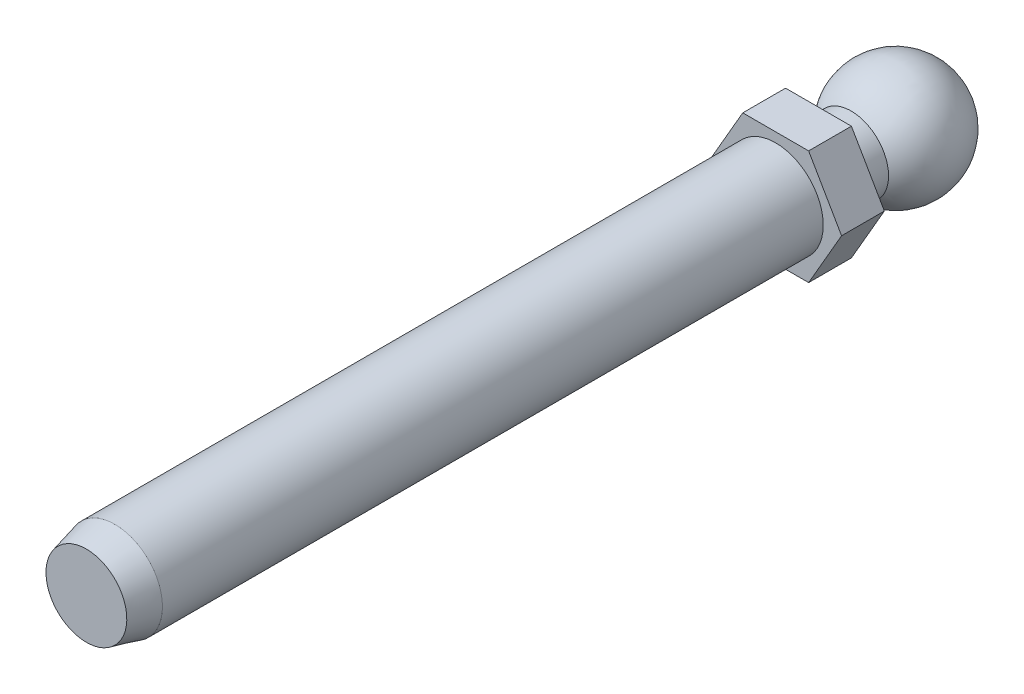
ISO-10303-21;
HEADER;
FILE_DESCRIPTION(('STEP AP214'),'2;1');
FILE_NAME('part.step','',(''),(''),'','','');
FILE_SCHEMA(('AUTOMOTIVE_DESIGN { 1 0 10303 214 1 1 1 1 }'));
ENDSEC;
DATA;
#1=APPLICATION_CONTEXT('core data for automotive mechanical design processes');
#2=APPLICATION_PROTOCOL_DEFINITION('international standard','automotive_design',2000,#1);
#3=PRODUCT_CONTEXT('',#1,'mechanical');
#4=PRODUCT('Part','Part','',(#3));
#5=PRODUCT_RELATED_PRODUCT_CATEGORY('part','',(#4));
#6=PRODUCT_DEFINITION_FORMATION('','',#4);
#7=PRODUCT_DEFINITION_CONTEXT('part definition',#1,'design');
#8=PRODUCT_DEFINITION('design','',#6,#7);
#9=PRODUCT_DEFINITION_SHAPE('','',#8);
#10=(LENGTH_UNIT() NAMED_UNIT(*) SI_UNIT(.MILLI.,.METRE.));
#11=(NAMED_UNIT(*) PLANE_ANGLE_UNIT() SI_UNIT($,.RADIAN.));
#12=(NAMED_UNIT(*) SI_UNIT($,.STERADIAN.) SOLID_ANGLE_UNIT());
#13=UNCERTAINTY_MEASURE_WITH_UNIT(LENGTH_MEASURE(1.E-05),#10,'distance_accuracy_value','');
#14=(GEOMETRIC_REPRESENTATION_CONTEXT(3) GLOBAL_UNCERTAINTY_ASSIGNED_CONTEXT((#13)) GLOBAL_UNIT_ASSIGNED_CONTEXT((#10,
#11,#12)) REPRESENTATION_CONTEXT('',''));
#15=CARTESIAN_POINT('',(0.,0.,0.));
#16=DIRECTION('',(0.,0.,1.));
#17=DIRECTION('',(1.,0.,0.));
#18=AXIS2_PLACEMENT_3D('',#15,#16,#17);
#19=CARTESIAN_POINT('',(0.,0.,0.));
#20=DIRECTION('',(1.,0.,0.));
#21=DIRECTION('',(0.,1.,0.));
#22=AXIS2_PLACEMENT_3D('',#19,#20,#21);
#23=SPHERICAL_SURFACE('',#22,12.25);
#24=CARTESIAN_POINT('',(-12.25,0.,0.));
#25=VERTEX_POINT('',#24);
#26=VERTEX_LOOP('',#25);
#27=FACE_BOUND('',#26,.T.);
#28=CARTESIAN_POINT('',(12.25,0.,0.));
#29=VERTEX_POINT('',#28);
#30=VERTEX_LOOP('',#29);
#31=FACE_BOUND('',#30,.T.);
#32=CARTESIAN_POINT('',(0.,0.,9.38332963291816));
#33=DIRECTION('',(0.,0.,1.));
#34=DIRECTION('',(1.,0.,0.));
#35=AXIS2_PLACEMENT_3D('',#32,#33,#34);
#36=CIRCLE('',#35,7.875);
#37=CARTESIAN_POINT('',(7.875,0.,9.38332963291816));
#38=VERTEX_POINT('',#37);
#39=EDGE_CURVE('E20',#38,#38,#36,.T.);
#40=ORIENTED_EDGE('',*,*,#39,.F.);
#41=EDGE_LOOP('',(#40));
#42=FACE_BOUND('',#41,.T.);
#43=ADVANCED_FACE('F16',(#27,#31,#42),#23,.T.);
#44=CARTESIAN_POINT('',(0.,0.,0.));
#45=DIRECTION('',(0.,0.,1.));
#46=DIRECTION('',(1.,0.,0.));
#47=AXIS2_PLACEMENT_3D('',#44,#45,#46);
#48=CYLINDRICAL_SURFACE('',#47,7.875);
#49=ORIENTED_EDGE('',*,*,#39,.T.);
#50=EDGE_LOOP('',(#49));
#51=FACE_BOUND('',#50,.T.);
#52=CARTESIAN_POINT('',(0.,0.,16.25));
#53=DIRECTION('',(0.,0.,1.));
#54=DIRECTION('',(1.,0.,0.));
#55=AXIS2_PLACEMENT_3D('',#52,#53,#54);
#56=CIRCLE('',#55,7.875);
#57=CARTESIAN_POINT('',(7.875,0.,16.25));
#58=VERTEX_POINT('',#57);
#59=EDGE_CURVE('E79',#58,#58,#56,.F.);
#60=ORIENTED_EDGE('',*,*,#59,.T.);
#61=EDGE_LOOP('',(#60));
#62=FACE_BOUND('',#61,.T.);
#63=ADVANCED_FACE('F74',(#51,#62),#48,.T.);
#64=CARTESIAN_POINT('',(0.,0.,16.25));
#65=DIRECTION('',(0.,0.,1.));
#66=DIRECTION('',(1.,0.,0.));
#67=AXIS2_PLACEMENT_3D('',#64,#65,#66);
#68=PLANE('',#67);
#69=ORIENTED_EDGE('',*,*,#59,.F.);
#70=EDGE_LOOP('',(#69));
#71=FACE_BOUND('',#70,.T.);
#72=DIRECTION('',(-0.5,0.866025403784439,0.));
#73=VECTOR('',#72,1.);
#74=CARTESIAN_POINT('',(6.92820323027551,12.,16.25));
#75=LINE('',#74,#73);
#76=CARTESIAN_POINT('',(13.856406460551,0.,16.25));
#77=VERTEX_POINT('',#76);
#78=CARTESIAN_POINT('',(6.92820323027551,12.,16.25));
#79=VERTEX_POINT('',#78);
#80=EDGE_CURVE('E81',#77,#79,#75,.T.);
#81=ORIENTED_EDGE('',*,*,#80,.F.);
#82=DIRECTION('',(0.5,0.866025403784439,0.));
#83=VECTOR('',#82,1.);
#84=CARTESIAN_POINT('',(13.856406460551,0.,16.25));
#85=LINE('',#84,#83);
#86=CARTESIAN_POINT('',(6.92820323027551,-12.,16.25));
#87=VERTEX_POINT('',#86);
#88=EDGE_CURVE('E114',#87,#77,#85,.T.);
#89=ORIENTED_EDGE('',*,*,#88,.F.);
#90=DIRECTION('',(1.,0.,0.));
#91=VECTOR('',#90,1.);
#92=CARTESIAN_POINT('',(6.92820323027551,-12.,16.25));
#93=LINE('',#92,#91);
#94=CARTESIAN_POINT('',(-6.92820323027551,-12.,16.25));
#95=VERTEX_POINT('',#94);
#96=EDGE_CURVE('E111',#95,#87,#93,.T.);
#97=ORIENTED_EDGE('',*,*,#96,.F.);
#98=DIRECTION('',(0.5,-0.866025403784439,0.));
#99=VECTOR('',#98,1.);
#100=CARTESIAN_POINT('',(-6.92820323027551,-12.,16.25));
#101=LINE('',#100,#99);
#102=CARTESIAN_POINT('',(-13.856406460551,0.,16.25));
#103=VERTEX_POINT('',#102);
#104=EDGE_CURVE('E106',#103,#95,#101,.T.);
#105=ORIENTED_EDGE('',*,*,#104,.F.);
#106=DIRECTION('',(-0.5,-0.866025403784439,0.));
#107=VECTOR('',#106,1.);
#108=CARTESIAN_POINT('',(-13.856406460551,0.,16.25));
#109=LINE('',#108,#107);
#110=CARTESIAN_POINT('',(-6.92820323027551,12.,16.25));
#111=VERTEX_POINT('',#110);
#112=EDGE_CURVE('E101',#111,#103,#109,.T.);
#113=ORIENTED_EDGE('',*,*,#112,.F.);
#114=DIRECTION('',(1.,0.,0.));
#115=VECTOR('',#114,1.);
#116=CARTESIAN_POINT('',(-6.92820323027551,12.,16.25));
#117=LINE('',#116,#115);
#118=EDGE_CURVE('E96',#79,#111,#117,.F.);
#119=ORIENTED_EDGE('',*,*,#118,.F.);
#120=EDGE_LOOP('',(#81,#89,#97,#105,#113,#119));
#121=FACE_BOUND('',#120,.T.);
#122=ADVANCED_FACE('F235',(#71,#121),#68,.F.);
#123=CARTESIAN_POINT('',(6.92820323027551,12.,16.25));
#124=DIRECTION('',(0.866025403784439,0.5,0.));
#125=DIRECTION('',(-0.5,0.866025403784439,0.));
#126=AXIS2_PLACEMENT_3D('',#123,#124,#125);
#127=PLANE('',#126);
#128=ORIENTED_EDGE('',*,*,#80,.T.);
#129=DIRECTION('',(0.,0.,1.));
#130=VECTOR('',#129,1.);
#131=CARTESIAN_POINT('',(6.92820323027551,12.,16.25));
#132=LINE('',#131,#130);
#133=CARTESIAN_POINT('',(6.92820323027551,12.,25.25));
#134=VERTEX_POINT('',#133);
#135=EDGE_CURVE('E84',#134,#79,#132,.F.);
#136=ORIENTED_EDGE('',*,*,#135,.F.);
#137=DIRECTION('',(-0.5,0.866025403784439,0.));
#138=VECTOR('',#137,1.);
#139=CARTESIAN_POINT('',(13.856406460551,0.,25.25));
#140=LINE('',#139,#138);
#141=CARTESIAN_POINT('',(13.856406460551,0.,25.25));
#142=VERTEX_POINT('',#141);
#143=EDGE_CURVE('E120',#142,#134,#140,.T.);
#144=ORIENTED_EDGE('',*,*,#143,.F.);
#145=DIRECTION('',(0.,0.,1.));
#146=VECTOR('',#145,1.);
#147=CARTESIAN_POINT('',(13.856406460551,0.,16.25));
#148=LINE('',#147,#146);
#149=EDGE_CURVE('E117',#77,#142,#148,.T.);
#150=ORIENTED_EDGE('',*,*,#149,.F.);
#151=EDGE_LOOP('',(#128,#136,#144,#150));
#152=FACE_BOUND('',#151,.T.);
#153=ADVANCED_FACE('F145',(#152),#127,.T.);
#154=CARTESIAN_POINT('',(-6.92820323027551,12.,16.25));
#155=DIRECTION('',(0.,1.,0.));
#156=DIRECTION('',(0.,0.,1.));
#157=AXIS2_PLACEMENT_3D('',#154,#155,#156);
#158=PLANE('',#157);
#159=ORIENTED_EDGE('',*,*,#118,.T.);
#160=DIRECTION('',(0.,0.,1.));
#161=VECTOR('',#160,1.);
#162=CARTESIAN_POINT('',(-6.92820323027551,12.,16.25));
#163=LINE('',#162,#161);
#164=CARTESIAN_POINT('',(-6.92820323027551,12.,25.25));
#165=VERTEX_POINT('',#164);
#166=EDGE_CURVE('E98',#165,#111,#163,.F.);
#167=ORIENTED_EDGE('',*,*,#166,.F.);
#168=DIRECTION('',(1.,0.,0.));
#169=VECTOR('',#168,1.);
#170=CARTESIAN_POINT('',(0.,12.,25.25));
#171=LINE('',#170,#169);
#172=EDGE_CURVE('E123',#134,#165,#171,.F.);
#173=ORIENTED_EDGE('',*,*,#172,.F.);
#174=ORIENTED_EDGE('',*,*,#135,.T.);
#175=EDGE_LOOP('',(#159,#167,#173,#174));
#176=FACE_BOUND('',#175,.T.);
#177=ADVANCED_FACE('F149',(#176),#158,.T.);
#178=CARTESIAN_POINT('',(-13.856406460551,0.,16.25));
#179=DIRECTION('',(-0.866025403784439,0.5,0.));
#180=DIRECTION('',(-0.5,-0.866025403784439,0.));
#181=AXIS2_PLACEMENT_3D('',#178,#179,#180);
#182=PLANE('',#181);
#183=ORIENTED_EDGE('',*,*,#112,.T.);
#184=DIRECTION('',(0.,0.,1.));
#185=VECTOR('',#184,1.);
#186=CARTESIAN_POINT('',(-13.856406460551,0.,16.25));
#187=LINE('',#186,#185);
#188=CARTESIAN_POINT('',(-13.856406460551,0.,25.25));
#189=VERTEX_POINT('',#188);
#190=EDGE_CURVE('E103',#189,#103,#187,.F.);
#191=ORIENTED_EDGE('',*,*,#190,.F.);
#192=DIRECTION('',(-0.5,-0.866025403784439,0.));
#193=VECTOR('',#192,1.);
#194=CARTESIAN_POINT('',(-6.92820323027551,12.,25.25));
#195=LINE('',#194,#193);
#196=EDGE_CURVE('E126',#165,#189,#195,.T.);
#197=ORIENTED_EDGE('',*,*,#196,.F.);
#198=ORIENTED_EDGE('',*,*,#166,.T.);
#199=EDGE_LOOP('',(#183,#191,#197,#198));
#200=FACE_BOUND('',#199,.T.);
#201=ADVANCED_FACE('F153',(#200),#182,.T.);
#202=CARTESIAN_POINT('',(-6.92820323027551,-12.,16.25));
#203=DIRECTION('',(-0.866025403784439,-0.5,0.));
#204=DIRECTION('',(0.5,-0.866025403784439,0.));
#205=AXIS2_PLACEMENT_3D('',#202,#203,#204);
#206=PLANE('',#205);
#207=ORIENTED_EDGE('',*,*,#104,.T.);
#208=DIRECTION('',(0.,0.,-1.));
#209=VECTOR('',#208,1.);
#210=CARTESIAN_POINT('',(-6.92820323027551,-12.,16.25));
#211=LINE('',#210,#209);
#212=CARTESIAN_POINT('',(-6.92820323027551,-12.,25.25));
#213=VERTEX_POINT('',#212);
#214=EDGE_CURVE('E108',#213,#95,#211,.T.);
#215=ORIENTED_EDGE('',*,*,#214,.F.);
#216=DIRECTION('',(0.5,-0.866025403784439,0.));
#217=VECTOR('',#216,1.);
#218=CARTESIAN_POINT('',(-13.856406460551,0.,25.25));
#219=LINE('',#218,#217);
#220=EDGE_CURVE('E129',#189,#213,#219,.T.);
#221=ORIENTED_EDGE('',*,*,#220,.F.);
#222=ORIENTED_EDGE('',*,*,#190,.T.);
#223=EDGE_LOOP('',(#207,#215,#221,#222));
#224=FACE_BOUND('',#223,.T.);
#225=ADVANCED_FACE('F157',(#224),#206,.T.);
#226=CARTESIAN_POINT('',(6.92820323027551,-12.,16.25));
#227=DIRECTION('',(0.,-1.,0.));
#228=DIRECTION('',(0.,0.,-1.));
#229=AXIS2_PLACEMENT_3D('',#226,#227,#228);
#230=PLANE('',#229);
#231=ORIENTED_EDGE('',*,*,#96,.T.);
#232=DIRECTION('',(0.,0.,1.));
#233=VECTOR('',#232,1.);
#234=CARTESIAN_POINT('',(6.92820323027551,-12.,16.25));
#235=LINE('',#234,#233);
#236=CARTESIAN_POINT('',(6.92820323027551,-12.,25.25));
#237=VERTEX_POINT('',#236);
#238=EDGE_CURVE('E35',#237,#87,#235,.F.);
#239=ORIENTED_EDGE('',*,*,#238,.F.);
#240=DIRECTION('',(1.,0.,0.));
#241=VECTOR('',#240,1.);
#242=CARTESIAN_POINT('',(0.,-12.,25.25));
#243=LINE('',#242,#241);
#244=EDGE_CURVE('E132',#213,#237,#243,.T.);
#245=ORIENTED_EDGE('',*,*,#244,.F.);
#246=ORIENTED_EDGE('',*,*,#214,.T.);
#247=EDGE_LOOP('',(#231,#239,#245,#246));
#248=FACE_BOUND('',#247,.T.);
#249=ADVANCED_FACE('F159',(#248),#230,.T.);
#250=CARTESIAN_POINT('',(13.856406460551,0.,16.25));
#251=DIRECTION('',(0.866025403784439,-0.5,0.));
#252=DIRECTION('',(0.5,0.866025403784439,0.));
#253=AXIS2_PLACEMENT_3D('',#250,#251,#252);
#254=PLANE('',#253);
#255=ORIENTED_EDGE('',*,*,#88,.T.);
#256=ORIENTED_EDGE('',*,*,#149,.T.);
#257=DIRECTION('',(0.5,0.866025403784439,0.));
#258=VECTOR('',#257,1.);
#259=CARTESIAN_POINT('',(6.92820323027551,-12.,25.25));
#260=LINE('',#259,#258);
#261=EDGE_CURVE('E90',#237,#142,#260,.T.);
#262=ORIENTED_EDGE('',*,*,#261,.F.);
#263=ORIENTED_EDGE('',*,*,#238,.T.);
#264=EDGE_LOOP('',(#255,#256,#262,#263));
#265=FACE_BOUND('',#264,.T.);
#266=ADVANCED_FACE('F141',(#265),#254,.T.);
#267=CARTESIAN_POINT('',(0.,0.,170.25));
#268=DIRECTION('',(0.,0.,-1.));
#269=DIRECTION('',(-1.,0.,0.));
#270=AXIS2_PLACEMENT_3D('',#267,#268,#269);
#271=PLANE('',#270);
#272=CARTESIAN_POINT('',(0.,0.,170.25000000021));
#273=DIRECTION('',(0.,0.,-1.));
#274=DIRECTION('',(0.,1.,0.));
#275=AXIS2_PLACEMENT_3D('',#272,#273,#274);
#276=CIRCLE('',#275,8.50000000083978);
#277=CARTESIAN_POINT('',(0.,8.50000000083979,170.25000000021));
#278=VERTEX_POINT('',#277);
#279=EDGE_CURVE('E87',#278,#278,#276,.T.);
#280=ORIENTED_EDGE('',*,*,#279,.F.);
#281=EDGE_LOOP('',(#280));
#282=FACE_BOUND('',#281,.T.);
#283=ADVANCED_FACE('F167',(#282),#271,.F.);
#284=CARTESIAN_POINT('',(0.,0.,25.25));
#285=DIRECTION('',(0.,0.,1.));
#286=DIRECTION('',(1.,0.,0.));
#287=AXIS2_PLACEMENT_3D('',#284,#285,#286);
#288=PLANE('',#287);
#289=CARTESIAN_POINT('',(0.,0.,25.25));
#290=DIRECTION('',(0.,0.,1.));
#291=DIRECTION('',(1.,0.,0.));
#292=AXIS2_PLACEMENT_3D('',#289,#290,#291);
#293=CIRCLE('',#292,10.);
#294=CARTESIAN_POINT('',(10.,0.,25.25));
#295=VERTEX_POINT('',#294);
#296=EDGE_CURVE('E26',#295,#295,#293,.T.);
#297=ORIENTED_EDGE('',*,*,#296,.F.);
#298=EDGE_LOOP('',(#297));
#299=FACE_BOUND('',#298,.T.);
#300=ORIENTED_EDGE('',*,*,#244,.T.);
#301=ORIENTED_EDGE('',*,*,#261,.T.);
#302=ORIENTED_EDGE('',*,*,#143,.T.);
#303=ORIENTED_EDGE('',*,*,#172,.T.);
#304=ORIENTED_EDGE('',*,*,#196,.T.);
#305=ORIENTED_EDGE('',*,*,#220,.T.);
#306=EDGE_LOOP('',(#300,#301,#302,#303,#304,#305));
#307=FACE_BOUND('',#306,.T.);
#308=ADVANCED_FACE('F139',(#299,#307),#288,.T.);
#309=CARTESIAN_POINT('',(0.,0.,164.24999999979));
#310=DIRECTION('',(0.,0.,-1.));
#311=DIRECTION('',(0.,1.,0.));
#312=AXIS2_PLACEMENT_3D('',#309,#310,#311);
#313=CONICAL_SURFACE('',#312,9.99999999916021,0.244978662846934);
#314=CARTESIAN_POINT('',(0.,0.,164.25));
#315=DIRECTION('',(0.,0.,1.));
#316=DIRECTION('',(1.,0.,0.));
#317=AXIS2_PLACEMENT_3D('',#314,#315,#316);
#318=CIRCLE('',#317,10.);
#319=CARTESIAN_POINT('',(10.,0.,164.25));
#320=VERTEX_POINT('',#319);
#321=EDGE_CURVE('E11',#320,#320,#318,.F.);
#322=ORIENTED_EDGE('',*,*,#321,.F.);
#323=EDGE_LOOP('',(#322));
#324=FACE_BOUND('',#323,.T.);
#325=ORIENTED_EDGE('',*,*,#279,.T.);
#326=EDGE_LOOP('',(#325));
#327=FACE_BOUND('',#326,.T.);
#328=ADVANCED_FACE('F172',(#324,#327),#313,.T.);
#329=CARTESIAN_POINT('',(0.,0.,25.25));
#330=DIRECTION('',(0.,0.,1.));
#331=DIRECTION('',(1.,0.,0.));
#332=AXIS2_PLACEMENT_3D('',#329,#330,#331);
#333=CYLINDRICAL_SURFACE('',#332,10.);
#334=ORIENTED_EDGE('',*,*,#321,.T.);
#335=EDGE_LOOP('',(#334));
#336=FACE_BOUND('',#335,.T.);
#337=ORIENTED_EDGE('',*,*,#296,.T.);
#338=EDGE_LOOP('',(#337));
#339=FACE_BOUND('',#338,.T.);
#340=ADVANCED_FACE('F170',(#336,#339),#333,.T.);
#341=CLOSED_SHELL('',(#43,#63,#122,#153,#177,#201,#225,#249,#266,#283,#308,#328,#340));
#342=MANIFOLD_SOLID_BREP('B1',#341);
#343=ADVANCED_BREP_SHAPE_REPRESENTATION('',(#18,#342),#14);
#344=SHAPE_DEFINITION_REPRESENTATION(#9,#343);
ENDSEC;
END-ISO-10303-21;
